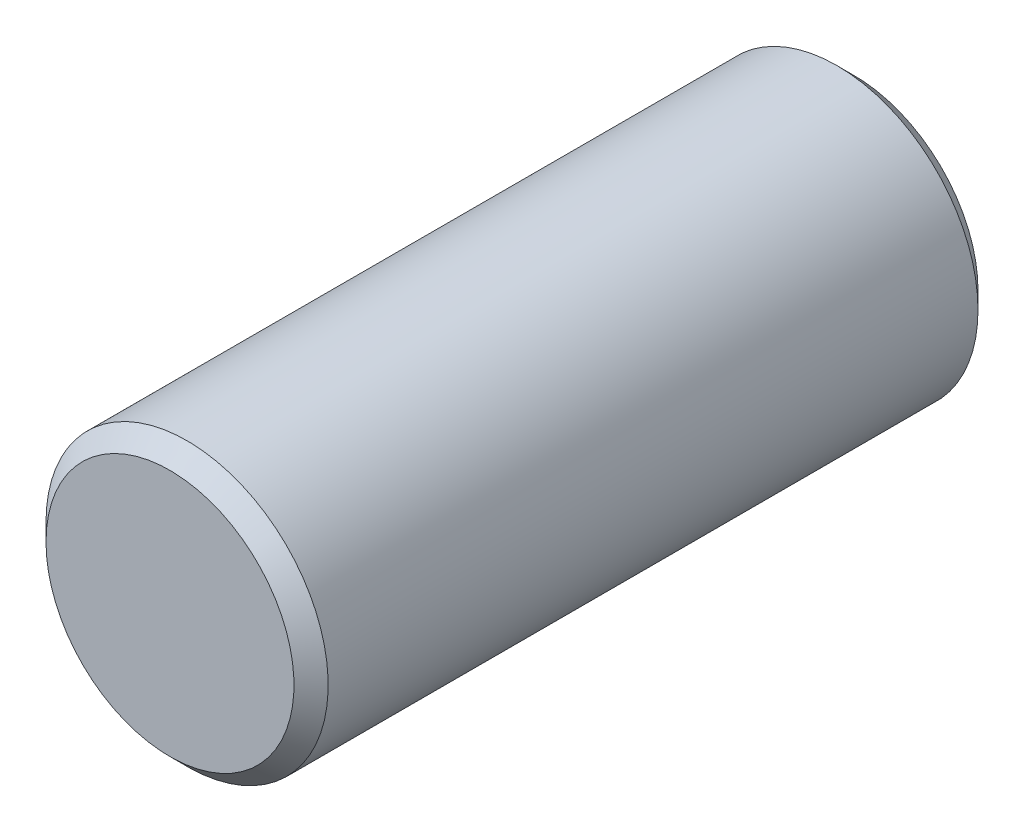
from build123d import *

# Parameters (mm, degrees)
ESQUISSE1_R      = 0.825
EXTRUSION1_DEPTH = 4
CHANFREIN1_SIZE  = 0.1


with BuildPart() as part:
    # Esquisse1 → Extrusion1 (new body)
    with BuildSketch(Plane.XY):
        Circle(ESQUISSE1_R)
    extrude(amount=EXTRUSION1_DEPTH)

    # Chanfrein1
    chanfrein1_edges = [part.edges().sort_by_distance(p)[0] for p in [
        (-0.825, 0, 0),
        (-0.825, 0, 4),
    ]]
    chamfer(chanfrein1_edges, length=CHANFREIN1_SIZE)


solid = part.part
